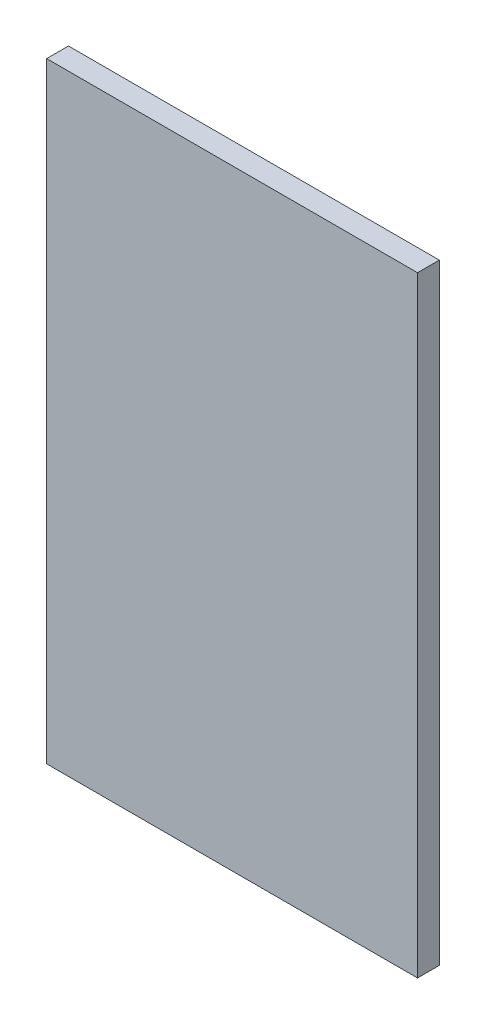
ISO-10303-21;
HEADER;
FILE_DESCRIPTION(('STEP AP214'),'2;1');
FILE_NAME('part.step','',(''),(''),'','','');
FILE_SCHEMA(('AUTOMOTIVE_DESIGN { 1 0 10303 214 1 1 1 1 }'));
ENDSEC;
DATA;
#1=APPLICATION_CONTEXT('core data for automotive mechanical design processes');
#2=APPLICATION_PROTOCOL_DEFINITION('international standard','automotive_design',2000,#1);
#3=PRODUCT_CONTEXT('',#1,'mechanical');
#4=PRODUCT('Part','Part','',(#3));
#5=PRODUCT_RELATED_PRODUCT_CATEGORY('part','',(#4));
#6=PRODUCT_DEFINITION_FORMATION('','',#4);
#7=PRODUCT_DEFINITION_CONTEXT('part definition',#1,'design');
#8=PRODUCT_DEFINITION('design','',#6,#7);
#9=PRODUCT_DEFINITION_SHAPE('','',#8);
#10=(LENGTH_UNIT() NAMED_UNIT(*) SI_UNIT(.MILLI.,.METRE.));
#11=(NAMED_UNIT(*) PLANE_ANGLE_UNIT() SI_UNIT($,.RADIAN.));
#12=(NAMED_UNIT(*) SI_UNIT($,.STERADIAN.) SOLID_ANGLE_UNIT());
#13=UNCERTAINTY_MEASURE_WITH_UNIT(LENGTH_MEASURE(1.E-05),#10,'distance_accuracy_value','');
#14=(GEOMETRIC_REPRESENTATION_CONTEXT(3) GLOBAL_UNCERTAINTY_ASSIGNED_CONTEXT((#13)) GLOBAL_UNIT_ASSIGNED_CONTEXT((#10,
#11,#12)) REPRESENTATION_CONTEXT('',''));
#15=CARTESIAN_POINT('',(0.,0.,0.));
#16=DIRECTION('',(0.,0.,1.));
#17=DIRECTION('',(1.,0.,0.));
#18=AXIS2_PLACEMENT_3D('',#15,#16,#17);
#19=CARTESIAN_POINT('',(0.,0.,5.));
#20=DIRECTION('',(1.,0.,0.));
#21=DIRECTION('',(0.,0.,-1.));
#22=AXIS2_PLACEMENT_3D('',#19,#20,#21);
#23=PLANE('',#22);
#24=DIRECTION('',(0.,-1.,0.));
#25=VECTOR('',#24,1.);
#26=CARTESIAN_POINT('',(0.,0.,0.));
#27=LINE('',#26,#25);
#28=CARTESIAN_POINT('',(0.,140.,0.));
#29=VERTEX_POINT('',#28);
#30=CARTESIAN_POINT('',(0.,0.,0.));
#31=VERTEX_POINT('',#30);
#32=EDGE_CURVE('E96',#29,#31,#27,.T.);
#33=ORIENTED_EDGE('',*,*,#32,.T.);
#34=DIRECTION('',(0.,0.,-1.));
#35=VECTOR('',#34,1.);
#36=CARTESIAN_POINT('',(0.,0.,5.));
#37=LINE('',#36,#35);
#38=CARTESIAN_POINT('',(0.,0.,5.));
#39=VERTEX_POINT('',#38);
#40=EDGE_CURVE('E11',#39,#31,#37,.T.);
#41=ORIENTED_EDGE('',*,*,#40,.F.);
#42=DIRECTION('',(0.,-1.,0.));
#43=VECTOR('',#42,1.);
#44=CARTESIAN_POINT('',(0.,0.,5.));
#45=LINE('',#44,#43);
#46=CARTESIAN_POINT('',(0.,140.,5.));
#47=VERTEX_POINT('',#46);
#48=EDGE_CURVE('E84',#47,#39,#45,.T.);
#49=ORIENTED_EDGE('',*,*,#48,.F.);
#50=DIRECTION('',(0.,0.,-1.));
#51=VECTOR('',#50,1.);
#52=CARTESIAN_POINT('',(0.,140.,5.));
#53=LINE('',#52,#51);
#54=EDGE_CURVE('E92',#47,#29,#53,.T.);
#55=ORIENTED_EDGE('',*,*,#54,.T.);
#56=EDGE_LOOP('',(#33,#41,#49,#55));
#57=FACE_BOUND('',#56,.T.);
#58=ADVANCED_FACE('F33',(#57),#23,.F.);
#59=CARTESIAN_POINT('',(0.,0.,5.));
#60=DIRECTION('',(0.,1.,0.));
#61=DIRECTION('',(0.,0.,1.));
#62=AXIS2_PLACEMENT_3D('',#59,#60,#61);
#63=PLANE('',#62);
#64=DIRECTION('',(1.,0.,0.));
#65=VECTOR('',#64,1.);
#66=CARTESIAN_POINT('',(0.,0.,0.));
#67=LINE('',#66,#65);
#68=CARTESIAN_POINT('',(85.,0.,0.));
#69=VERTEX_POINT('',#68);
#70=EDGE_CURVE('E88',#31,#69,#67,.T.);
#71=ORIENTED_EDGE('',*,*,#70,.T.);
#72=DIRECTION('',(0.,0.,-1.));
#73=VECTOR('',#72,1.);
#74=CARTESIAN_POINT('',(85.,0.,5.));
#75=LINE('',#74,#73);
#76=CARTESIAN_POINT('',(85.,0.,5.));
#77=VERTEX_POINT('',#76);
#78=EDGE_CURVE('E41',#77,#69,#75,.T.);
#79=ORIENTED_EDGE('',*,*,#78,.F.);
#80=DIRECTION('',(1.,0.,0.));
#81=VECTOR('',#80,1.);
#82=CARTESIAN_POINT('',(0.,0.,5.));
#83=LINE('',#82,#81);
#84=EDGE_CURVE('E79',#39,#77,#83,.T.);
#85=ORIENTED_EDGE('',*,*,#84,.F.);
#86=ORIENTED_EDGE('',*,*,#40,.T.);
#87=EDGE_LOOP('',(#71,#79,#85,#86));
#88=FACE_BOUND('',#87,.T.);
#89=ADVANCED_FACE('F87',(#88),#63,.F.);
#90=CARTESIAN_POINT('',(85.,0.,5.));
#91=DIRECTION('',(-1.,0.,0.));
#92=DIRECTION('',(0.,0.,1.));
#93=AXIS2_PLACEMENT_3D('',#90,#91,#92);
#94=PLANE('',#93);
#95=DIRECTION('',(0.,1.,0.));
#96=VECTOR('',#95,1.);
#97=CARTESIAN_POINT('',(85.,0.,0.));
#98=LINE('',#97,#96);
#99=CARTESIAN_POINT('',(85.,140.,0.));
#100=VERTEX_POINT('',#99);
#101=EDGE_CURVE('E66',#69,#100,#98,.T.);
#102=ORIENTED_EDGE('',*,*,#101,.T.);
#103=DIRECTION('',(0.,0.,-1.));
#104=VECTOR('',#103,1.);
#105=CARTESIAN_POINT('',(85.,140.,5.));
#106=LINE('',#105,#104);
#107=CARTESIAN_POINT('',(85.,140.,5.));
#108=VERTEX_POINT('',#107);
#109=EDGE_CURVE('E89',#108,#100,#106,.T.);
#110=ORIENTED_EDGE('',*,*,#109,.F.);
#111=DIRECTION('',(0.,1.,0.));
#112=VECTOR('',#111,1.);
#113=CARTESIAN_POINT('',(85.,0.,5.));
#114=LINE('',#113,#112);
#115=EDGE_CURVE('E82',#77,#108,#114,.T.);
#116=ORIENTED_EDGE('',*,*,#115,.F.);
#117=ORIENTED_EDGE('',*,*,#78,.T.);
#118=EDGE_LOOP('',(#102,#110,#116,#117));
#119=FACE_BOUND('',#118,.T.);
#120=ADVANCED_FACE('F90',(#119),#94,.F.);
#121=CARTESIAN_POINT('',(0.,140.,5.));
#122=DIRECTION('',(0.,-1.,0.));
#123=DIRECTION('',(0.,0.,-1.));
#124=AXIS2_PLACEMENT_3D('',#121,#122,#123);
#125=PLANE('',#124);
#126=DIRECTION('',(-1.,0.,0.));
#127=VECTOR('',#126,1.);
#128=CARTESIAN_POINT('',(0.,140.,0.));
#129=LINE('',#128,#127);
#130=EDGE_CURVE('E72',#100,#29,#129,.T.);
#131=ORIENTED_EDGE('',*,*,#130,.T.);
#132=ORIENTED_EDGE('',*,*,#54,.F.);
#133=DIRECTION('',(-1.,0.,0.));
#134=VECTOR('',#133,1.);
#135=CARTESIAN_POINT('',(0.,140.,5.));
#136=LINE('',#135,#134);
#137=EDGE_CURVE('E49',#108,#47,#136,.T.);
#138=ORIENTED_EDGE('',*,*,#137,.F.);
#139=ORIENTED_EDGE('',*,*,#109,.T.);
#140=EDGE_LOOP('',(#131,#132,#138,#139));
#141=FACE_BOUND('',#140,.T.);
#142=ADVANCED_FACE('F103',(#141),#125,.F.);
#143=CARTESIAN_POINT('',(0.,140.,5.));
#144=DIRECTION('',(0.,0.,-1.));
#145=DIRECTION('',(-1.,0.,0.));
#146=AXIS2_PLACEMENT_3D('',#143,#144,#145);
#147=PLANE('',#146);
#148=ORIENTED_EDGE('',*,*,#48,.T.);
#149=ORIENTED_EDGE('',*,*,#84,.T.);
#150=ORIENTED_EDGE('',*,*,#115,.T.);
#151=ORIENTED_EDGE('',*,*,#137,.T.);
#152=EDGE_LOOP('',(#148,#149,#150,#151));
#153=FACE_BOUND('',#152,.T.);
#154=ADVANCED_FACE('F80',(#153),#147,.F.);
#155=CARTESIAN_POINT('',(0.,140.,0.));
#156=DIRECTION('',(0.,0.,-1.));
#157=DIRECTION('',(-1.,0.,0.));
#158=AXIS2_PLACEMENT_3D('',#155,#156,#157);
#159=PLANE('',#158);
#160=ORIENTED_EDGE('',*,*,#32,.F.);
#161=ORIENTED_EDGE('',*,*,#130,.F.);
#162=ORIENTED_EDGE('',*,*,#101,.F.);
#163=ORIENTED_EDGE('',*,*,#70,.F.);
#164=EDGE_LOOP('',(#160,#161,#162,#163));
#165=FACE_BOUND('',#164,.T.);
#166=ADVANCED_FACE('F106',(#165),#159,.T.);
#167=CLOSED_SHELL('',(#58,#89,#120,#142,#154,#166));
#168=MANIFOLD_SOLID_BREP('B2',#167);
#169=ADVANCED_BREP_SHAPE_REPRESENTATION('',(#18,#168),#14);
#170=SHAPE_DEFINITION_REPRESENTATION(#9,#169);
ENDSEC;
END-ISO-10303-21;
